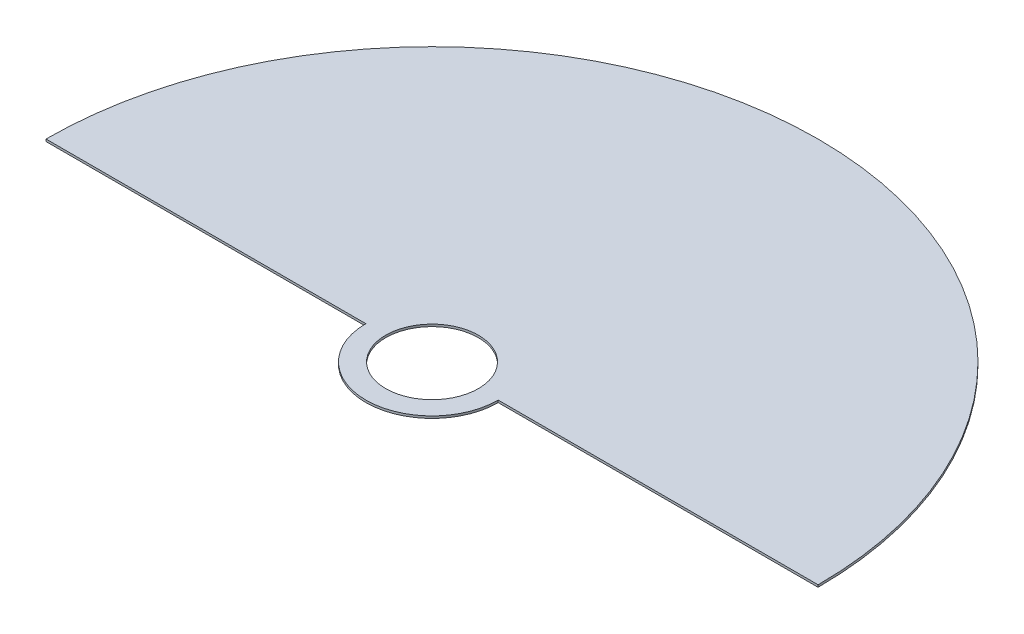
ISO-10303-21;
HEADER;
FILE_DESCRIPTION(('STEP AP214'),'2;1');
FILE_NAME('part.step','',(''),(''),'','','');
FILE_SCHEMA(('AUTOMOTIVE_DESIGN { 1 0 10303 214 1 1 1 1 }'));
ENDSEC;
DATA;
#1=APPLICATION_CONTEXT('core data for automotive mechanical design processes');
#2=APPLICATION_PROTOCOL_DEFINITION('international standard','automotive_design',2000,#1);
#3=PRODUCT_CONTEXT('',#1,'mechanical');
#4=PRODUCT('Part','Part','',(#3));
#5=PRODUCT_RELATED_PRODUCT_CATEGORY('part','',(#4));
#6=PRODUCT_DEFINITION_FORMATION('','',#4);
#7=PRODUCT_DEFINITION_CONTEXT('part definition',#1,'design');
#8=PRODUCT_DEFINITION('design','',#6,#7);
#9=PRODUCT_DEFINITION_SHAPE('','',#8);
#10=(LENGTH_UNIT() NAMED_UNIT(*) SI_UNIT(.MILLI.,.METRE.));
#11=(NAMED_UNIT(*) PLANE_ANGLE_UNIT() SI_UNIT($,.RADIAN.));
#12=(NAMED_UNIT(*) SI_UNIT($,.STERADIAN.) SOLID_ANGLE_UNIT());
#13=UNCERTAINTY_MEASURE_WITH_UNIT(LENGTH_MEASURE(1.E-05),#10,'distance_accuracy_value','');
#14=(GEOMETRIC_REPRESENTATION_CONTEXT(3) GLOBAL_UNCERTAINTY_ASSIGNED_CONTEXT((#13)) GLOBAL_UNIT_ASSIGNED_CONTEXT((#10,
#11,#12)) REPRESENTATION_CONTEXT('',''));
#15=CARTESIAN_POINT('',(0.,0.,0.));
#16=DIRECTION('',(0.,0.,1.));
#17=DIRECTION('',(1.,0.,0.));
#18=AXIS2_PLACEMENT_3D('',#15,#16,#17);
#19=CARTESIAN_POINT('',(0.,-1.,0.));
#20=DIRECTION('',(0.,1.,0.));
#21=DIRECTION('',(0.,0.,1.));
#22=AXIS2_PLACEMENT_3D('',#19,#20,#21);
#23=CYLINDRICAL_SURFACE('',#22,30.);
#24=CARTESIAN_POINT('',(0.,0.,0.));
#25=DIRECTION('',(0.,1.,0.));
#26=DIRECTION('',(0.,0.,1.));
#27=AXIS2_PLACEMENT_3D('',#24,#25,#26);
#28=CIRCLE('',#27,30.);
#29=CARTESIAN_POINT('',(-30.,0.,0.));
#30=VERTEX_POINT('',#29);
#31=CARTESIAN_POINT('',(30.,0.,0.));
#32=VERTEX_POINT('',#31);
#33=EDGE_CURVE('E105',#30,#32,#28,.T.);
#34=ORIENTED_EDGE('',*,*,#33,.F.);
#35=DIRECTION('',(0.,1.,0.));
#36=VECTOR('',#35,1.);
#37=CARTESIAN_POINT('',(-30.,-1.,0.));
#38=LINE('',#37,#36);
#39=CARTESIAN_POINT('',(-30.,-1.,0.));
#40=VERTEX_POINT('',#39);
#41=EDGE_CURVE('E11',#40,#30,#38,.T.);
#42=ORIENTED_EDGE('',*,*,#41,.F.);
#43=CARTESIAN_POINT('',(0.,-1.,0.));
#44=DIRECTION('',(0.,1.,0.));
#45=DIRECTION('',(0.,0.,1.));
#46=AXIS2_PLACEMENT_3D('',#43,#44,#45);
#47=CIRCLE('',#46,30.);
#48=CARTESIAN_POINT('',(30.,-1.,0.));
#49=VERTEX_POINT('',#48);
#50=EDGE_CURVE('E98',#40,#49,#47,.T.);
#51=ORIENTED_EDGE('',*,*,#50,.T.);
#52=DIRECTION('',(0.,1.,0.));
#53=VECTOR('',#52,1.);
#54=CARTESIAN_POINT('',(30.,-1.,0.));
#55=LINE('',#54,#53);
#56=EDGE_CURVE('E43',#49,#32,#55,.T.);
#57=ORIENTED_EDGE('',*,*,#56,.T.);
#58=EDGE_LOOP('',(#34,#42,#51,#57));
#59=FACE_BOUND('',#58,.T.);
#60=ADVANCED_FACE('F39',(#59),#23,.T.);
#61=CARTESIAN_POINT('',(-175.,-1.,0.));
#62=DIRECTION('',(0.,0.,1.));
#63=DIRECTION('',(1.,0.,0.));
#64=AXIS2_PLACEMENT_3D('',#61,#62,#63);
#65=PLANE('',#64);
#66=DIRECTION('',(1.,0.,0.));
#67=VECTOR('',#66,1.);
#68=CARTESIAN_POINT('',(-175.,0.,0.));
#69=LINE('',#68,#67);
#70=CARTESIAN_POINT('',(-175.,0.,0.));
#71=VERTEX_POINT('',#70);
#72=EDGE_CURVE('E100',#71,#30,#69,.T.);
#73=ORIENTED_EDGE('',*,*,#72,.F.);
#74=DIRECTION('',(0.,1.,0.));
#75=VECTOR('',#74,1.);
#76=CARTESIAN_POINT('',(-175.,-1.,0.));
#77=LINE('',#76,#75);
#78=CARTESIAN_POINT('',(-175.,-1.,0.));
#79=VERTEX_POINT('',#78);
#80=EDGE_CURVE('E49',#79,#71,#77,.T.);
#81=ORIENTED_EDGE('',*,*,#80,.F.);
#82=DIRECTION('',(1.,0.,0.));
#83=VECTOR('',#82,1.);
#84=CARTESIAN_POINT('',(-175.,-1.,0.));
#85=LINE('',#84,#83);
#86=EDGE_CURVE('E95',#79,#40,#85,.T.);
#87=ORIENTED_EDGE('',*,*,#86,.T.);
#88=ORIENTED_EDGE('',*,*,#41,.T.);
#89=EDGE_LOOP('',(#73,#81,#87,#88));
#90=FACE_BOUND('',#89,.T.);
#91=ADVANCED_FACE('F115',(#90),#65,.T.);
#92=CARTESIAN_POINT('',(0.,-1.,0.));
#93=DIRECTION('',(0.,1.,0.));
#94=DIRECTION('',(0.,0.,1.));
#95=AXIS2_PLACEMENT_3D('',#92,#93,#94);
#96=CYLINDRICAL_SURFACE('',#95,175.);
#97=CARTESIAN_POINT('',(0.,0.,0.));
#98=DIRECTION('',(0.,1.,0.));
#99=DIRECTION('',(0.,0.,1.));
#100=AXIS2_PLACEMENT_3D('',#97,#98,#99);
#101=CIRCLE('',#100,175.);
#102=CARTESIAN_POINT('',(175.,0.,0.));
#103=VERTEX_POINT('',#102);
#104=EDGE_CURVE('E90',#103,#71,#101,.T.);
#105=ORIENTED_EDGE('',*,*,#104,.F.);
#106=DIRECTION('',(0.,1.,0.));
#107=VECTOR('',#106,1.);
#108=CARTESIAN_POINT('',(175.,-1.,0.));
#109=LINE('',#108,#107);
#110=CARTESIAN_POINT('',(175.,-1.,0.));
#111=VERTEX_POINT('',#110);
#112=EDGE_CURVE('E85',#111,#103,#109,.T.);
#113=ORIENTED_EDGE('',*,*,#112,.F.);
#114=CARTESIAN_POINT('',(0.,-1.,0.));
#115=DIRECTION('',(0.,1.,0.));
#116=DIRECTION('',(0.,0.,1.));
#117=AXIS2_PLACEMENT_3D('',#114,#115,#116);
#118=CIRCLE('',#117,175.);
#119=EDGE_CURVE('E88',#111,#79,#118,.T.);
#120=ORIENTED_EDGE('',*,*,#119,.T.);
#121=ORIENTED_EDGE('',*,*,#80,.T.);
#122=EDGE_LOOP('',(#105,#113,#120,#121));
#123=FACE_BOUND('',#122,.T.);
#124=ADVANCED_FACE('F87',(#123),#96,.T.);
#125=CARTESIAN_POINT('',(30.,-1.,0.));
#126=DIRECTION('',(0.,0.,1.));
#127=DIRECTION('',(1.,0.,0.));
#128=AXIS2_PLACEMENT_3D('',#125,#126,#127);
#129=PLANE('',#128);
#130=DIRECTION('',(1.,0.,0.));
#131=VECTOR('',#130,1.);
#132=CARTESIAN_POINT('',(30.,0.,0.));
#133=LINE('',#132,#131);
#134=EDGE_CURVE('E108',#32,#103,#133,.T.);
#135=ORIENTED_EDGE('',*,*,#134,.F.);
#136=ORIENTED_EDGE('',*,*,#56,.F.);
#137=DIRECTION('',(1.,0.,0.));
#138=VECTOR('',#137,1.);
#139=CARTESIAN_POINT('',(30.,-1.,0.));
#140=LINE('',#139,#138);
#141=EDGE_CURVE('E94',#49,#111,#140,.T.);
#142=ORIENTED_EDGE('',*,*,#141,.T.);
#143=ORIENTED_EDGE('',*,*,#112,.T.);
#144=EDGE_LOOP('',(#135,#136,#142,#143));
#145=FACE_BOUND('',#144,.T.);
#146=ADVANCED_FACE('F97',(#145),#129,.T.);
#147=CARTESIAN_POINT('',(0.,-1.,0.));
#148=DIRECTION('',(0.,1.,0.));
#149=DIRECTION('',(0.,0.,1.));
#150=AXIS2_PLACEMENT_3D('',#147,#148,#149);
#151=PLANE('',#150);
#152=CARTESIAN_POINT('',(0.,-1.,0.));
#153=DIRECTION('',(0.,1.,0.));
#154=DIRECTION('',(0.,0.,1.));
#155=AXIS2_PLACEMENT_3D('',#152,#153,#154);
#156=CIRCLE('',#155,21.);
#157=CARTESIAN_POINT('',(0.,-1.,21.));
#158=VERTEX_POINT('',#157);
#159=EDGE_CURVE('E109',#158,#158,#156,.T.);
#160=ORIENTED_EDGE('',*,*,#159,.T.);
#161=EDGE_LOOP('',(#160));
#162=FACE_BOUND('',#161,.T.);
#163=ORIENTED_EDGE('',*,*,#50,.F.);
#164=ORIENTED_EDGE('',*,*,#86,.F.);
#165=ORIENTED_EDGE('',*,*,#119,.F.);
#166=ORIENTED_EDGE('',*,*,#141,.F.);
#167=EDGE_LOOP('',(#163,#164,#165,#166));
#168=FACE_BOUND('',#167,.T.);
#169=ADVANCED_FACE('F93',(#162,#168),#151,.F.);
#170=CARTESIAN_POINT('',(0.,0.,0.));
#171=DIRECTION('',(0.,1.,0.));
#172=DIRECTION('',(0.,0.,1.));
#173=AXIS2_PLACEMENT_3D('',#170,#171,#172);
#174=PLANE('',#173);
#175=CARTESIAN_POINT('',(0.,0.,0.));
#176=DIRECTION('',(0.,1.,0.));
#177=DIRECTION('',(0.,0.,1.));
#178=AXIS2_PLACEMENT_3D('',#175,#176,#177);
#179=CIRCLE('',#178,21.);
#180=CARTESIAN_POINT('',(0.,0.,21.));
#181=VERTEX_POINT('',#180);
#182=EDGE_CURVE('E139',#181,#181,#179,.T.);
#183=ORIENTED_EDGE('',*,*,#182,.F.);
#184=EDGE_LOOP('',(#183));
#185=FACE_BOUND('',#184,.T.);
#186=ORIENTED_EDGE('',*,*,#33,.T.);
#187=ORIENTED_EDGE('',*,*,#134,.T.);
#188=ORIENTED_EDGE('',*,*,#104,.T.);
#189=ORIENTED_EDGE('',*,*,#72,.T.);
#190=EDGE_LOOP('',(#186,#187,#188,#189));
#191=FACE_BOUND('',#190,.T.);
#192=ADVANCED_FACE('F41',(#185,#191),#174,.T.);
#193=CARTESIAN_POINT('',(0.,-1.,0.));
#194=DIRECTION('',(0.,1.,0.));
#195=DIRECTION('',(0.,0.,1.));
#196=AXIS2_PLACEMENT_3D('',#193,#194,#195);
#197=CYLINDRICAL_SURFACE('',#196,21.);
#198=ORIENTED_EDGE('',*,*,#159,.F.);
#199=EDGE_LOOP('',(#198));
#200=FACE_BOUND('',#199,.T.);
#201=ORIENTED_EDGE('',*,*,#182,.T.);
#202=EDGE_LOOP('',(#201));
#203=FACE_BOUND('',#202,.T.);
#204=ADVANCED_FACE('F134',(#200,#203),#197,.F.);
#205=CLOSED_SHELL('',(#60,#91,#124,#146,#169,#192,#204));
#206=MANIFOLD_SOLID_BREP('B2',#205);
#207=ADVANCED_BREP_SHAPE_REPRESENTATION('',(#18,#206),#14);
#208=SHAPE_DEFINITION_REPRESENTATION(#9,#207);
ENDSEC;
END-ISO-10303-21;
